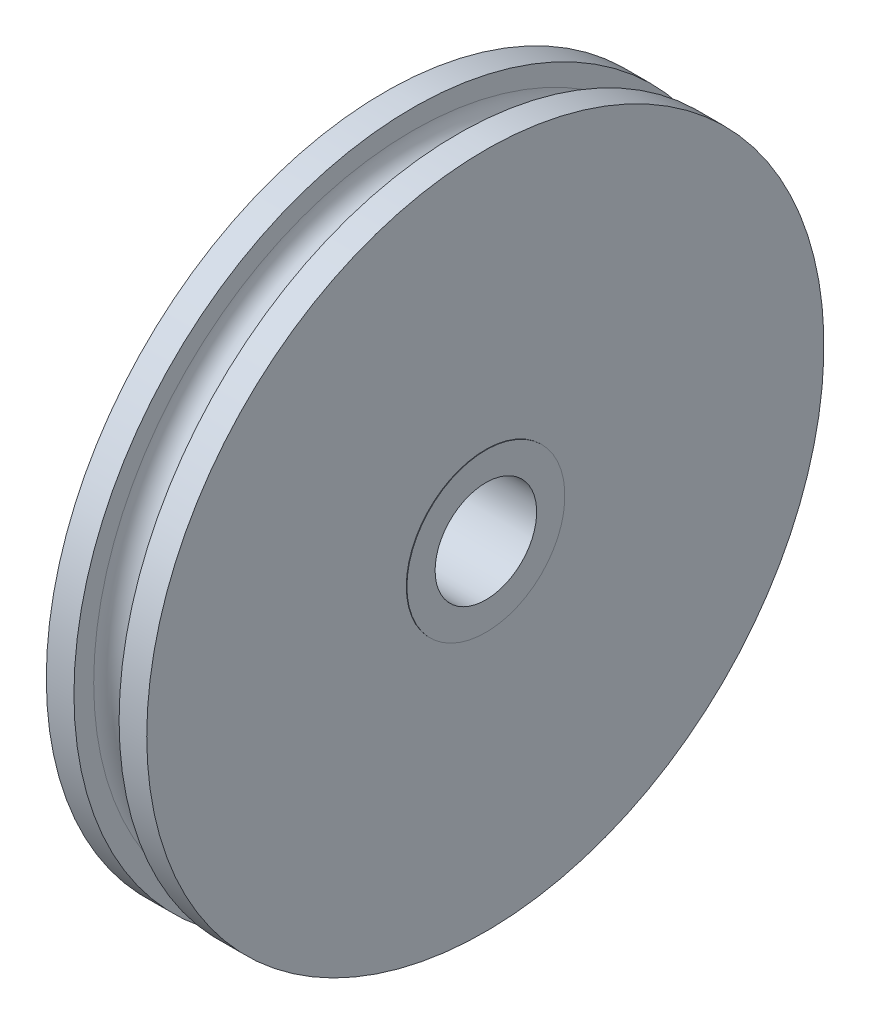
from build123d import *


with BuildPart() as part:
    # Esquisse1 → R_volution1 (revolve)
    with BuildSketch(Plane(origin=(0, 0, 0), x_dir=(1, 0, 0), z_dir=(0, 1, 0)), mode=Mode.PRIVATE) as r_volution1_sk:
        with BuildLine():
            Line((9, 9), (-9, 9))
            Line((-9, 9), (-9, 14))
            Line((-9, 14), (-8.9, 14))
            Line((-8.9, 14), (-8.9, 60))
            Line((-8.9, 60), (-4, 60))
            Line((-4, 60), (-4, 56.5))
            ThreePointArc((-4, 56.5), (0, 52.5), (4, 56.5))
            Line((4, 56.5), (4, 60))
            Line((4, 60), (8.9, 60))
            Line((8.9, 60), (8.9, 14))
            Line((8.9, 14), (9, 14))
            Line((9, 14), (9, 9))
        make_face()
    revolve(r_volution1_sk.sketch.rotate(Axis((-12.5, 0, 0), (1, 0, 0)), 180), axis=Axis((-12.5, 0, 0), (1, 0, 0)))


solid = part.part
